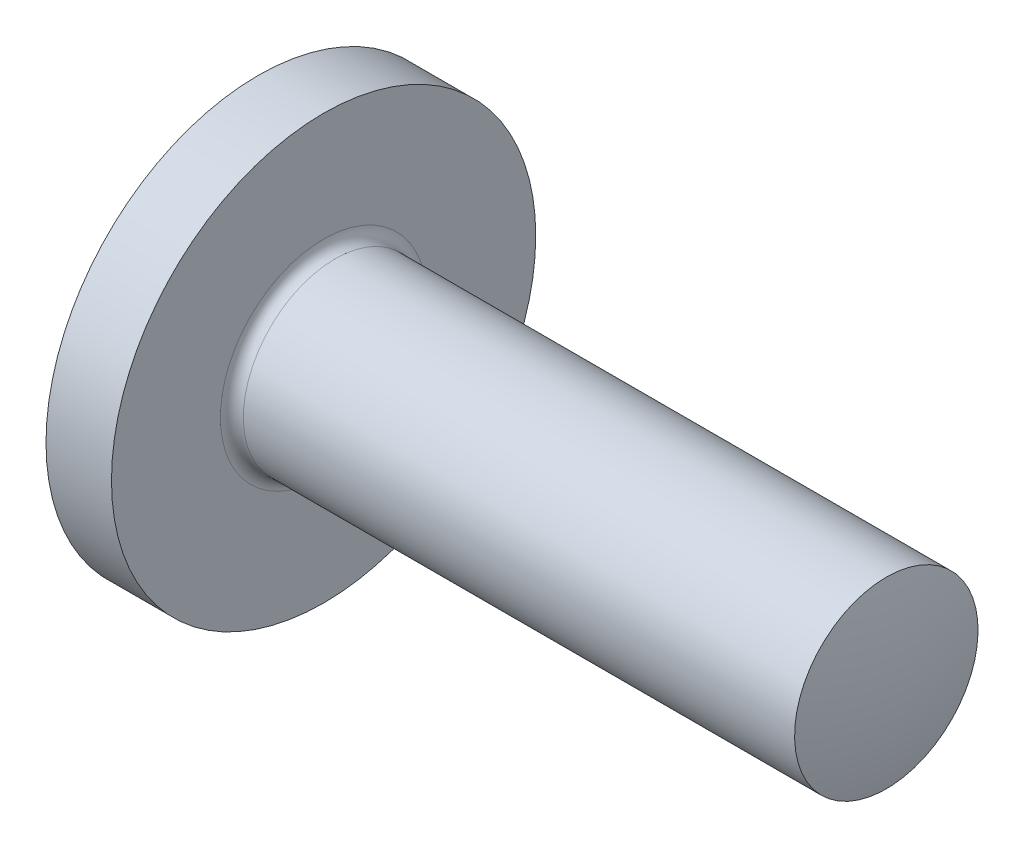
from build123d import *

# Parameters (mm, degrees)
SKETCH1_R       = 1.85
BASEHEAD_DEPTH  = 1.1
SKETCH2_R       = 0.8
BASEBODY_DEPTH  = 5
SLOT_DEPTH      = 7.637394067
SLOT_DEPTH_BACK = 7.637394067
SKETCH3_W       = 0.5
SKETCH3_H       = 0.5
HEADFILLET_R    = 0.1


with BuildPart() as part:
    # Sketch1 → BaseHead (new body)
    with BuildSketch(Plane(origin=(0, 0, 0), x_dir=(0, 0, -1), z_dir=(1, 0, 0))):
        Circle(SKETCH1_R)
    extrude(amount=BASEHEAD_DEPTH)

    # Sketch2 → BaseBody (add)
    with BuildSketch(Plane(origin=(1.1, 0.067556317, 0.30150137), x_dir=(0, 0, -1), z_dir=(1, 0, 0))):
        with Locations((0.30150137, -0.067556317)):
            Circle(SKETCH2_R)
    extrude(amount=BASEBODY_DEPTH)

    # Sketch3 → Slot (cut, two sides: drawn at the far end of the back side and taken through both)
    with BuildSketch(Plane.XY.offset(-SLOT_DEPTH_BACK)):
        with Locations((0.25, 0)):
            Rectangle(SKETCH3_W, SKETCH3_H)
    extrude(amount=SLOT_DEPTH + SLOT_DEPTH_BACK, mode=Mode.SUBTRACT)

    # Sketch4 → BaseTop (revolve, cut)
    with BuildSketch(Plane(origin=(-5.763764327, 3.913764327, 0), x_dir=(0, -1, 0), z_dir=(0, 0, 1))):
        with BuildLine():
            Line((3.113764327, 13.863764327), (3.113764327, 11.771109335))
            ThreePointArc((3.113764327, 11.771109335), (3.511090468, 11.840523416), (3.913764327, 11.863764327))
            Line((3.913764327, 11.863764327), (3.913764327, 13.863764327))
            Line((3.913764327, 13.863764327), (3.113764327, 13.863764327))
        make_face()
        with BuildLine():
            Line((2.063764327, 3.763764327), (3.913764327, 3.763764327))
            Line((3.913764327, 3.763764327), (3.913764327, 5.763764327))
            ThreePointArc((3.913764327, 5.763764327), (2.951706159, 5.898583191), (2.063764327, 6.292653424))
            Line((2.063764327, 6.292653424), (2.063764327, 3.763764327))
        make_face()
    revolve(axis=Axis((9.335097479, 0, 0), (-1, 0, 0)), mode=Mode.SUBTRACT)

    # HeadFillet
    headfillet_edges = [part.edges().sort_by_distance(p)[0] for p in [
        (1.1, 0, 0.8),
    ]]
    fillet(headfillet_edges, radius=HEADFILLET_R)


solid = part.part
